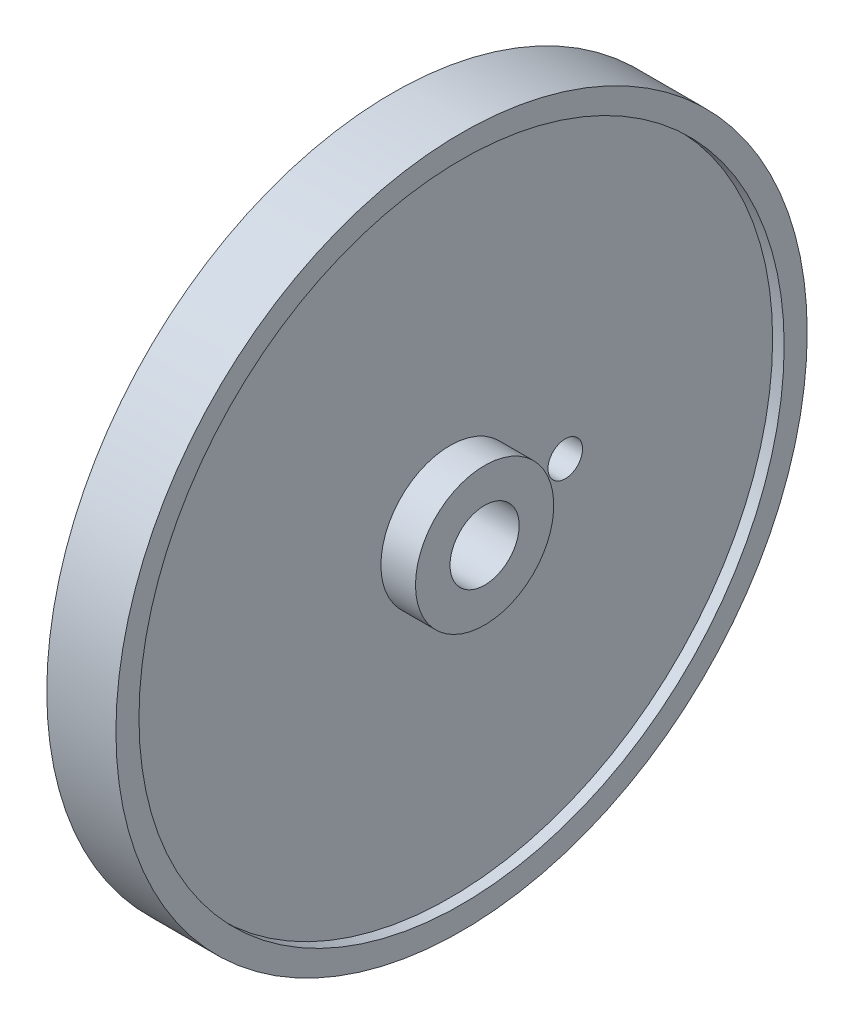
from build123d import *

# Parameters (mm, degrees)
SKETCH3_R      = 1.5
EXTRUDE2_DEPTH = 10


with BuildPart() as part:
    # Sketch1 → Revolve1 (revolve)
    with BuildSketch(Plane.XY, mode=Mode.PRIVATE) as revolve1_sk:
        Polygon((-5, 3), (5, 3), (5, 6), (2, 6), (2, 28), (3, 28), (3, 30), (-3, 30), (-3, 28), (-2, 28), (-2, 6), (-5, 6), align=None)
    revolve(revolve1_sk.sketch.rotate(Axis((-5.757546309, 0, 0), (1, 0, 0)), 90), axis=Axis((-5.757546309, 0, 0), (1, 0, 0)))

    # Sketch3 → Extrude2 (cut)
    with BuildSketch(Plane(origin=(2, 0, 0), x_dir=(0, 0, -1), z_dir=(1, 0, 0))):
        with Locations((10, 0)):
            Circle(SKETCH3_R)
    extrude(amount=-EXTRUDE2_DEPTH, mode=Mode.SUBTRACT)


solid = part.part
